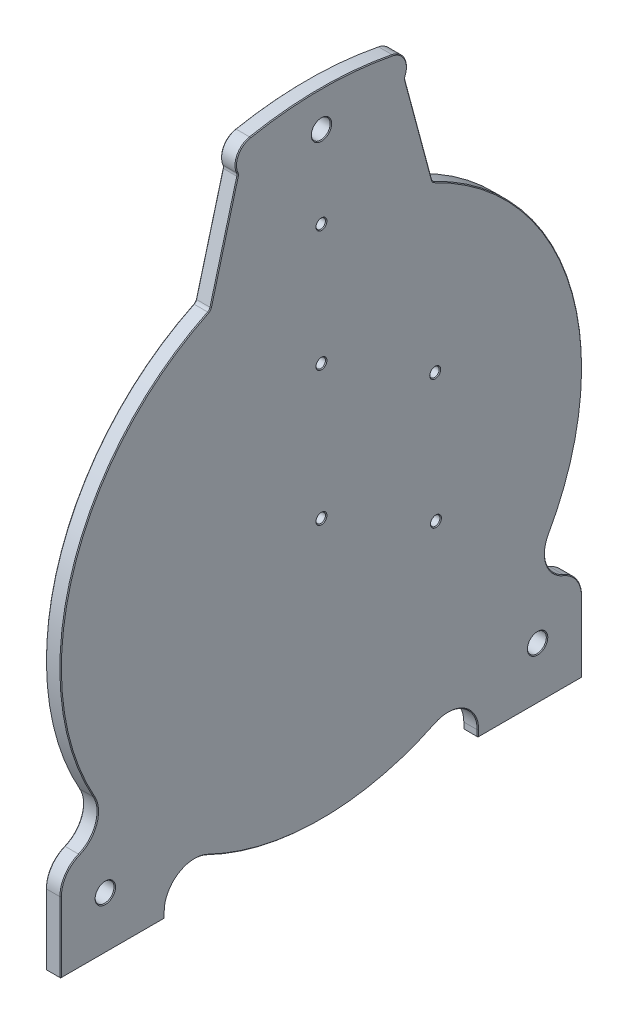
from build123d import *

# Parameters (mm, degrees)
SKETCH_1_R      = 3.175
SKETCH_1_R_2    = 6.35
EXTRUDE_1_DEPTH = 10
FILLET_1_R      = 3
CHAMFER_1_SIZE  = 0.5


with BuildPart() as part:
    # Sketch 1 → Extrude 1 (new body)
    with BuildSketch(Plane(origin=(0, 0, 0), x_dir=(0, 0, -1), z_dir=(1, 0, 0))):
        with BuildLine():
            Line((-56.02, 227.837072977), (-74.659059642, 158.275155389))
            ThreePointArc((-74.659059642, 158.275155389), (-166.695550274, 53.269067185), (-152.607561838, -85.650055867))
            ThreePointArc((-152.607561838, -85.650055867), (-151.17227957, -102.048557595), (-162.524213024, -113.96931684))
            ThreePointArc((-162.524213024, -113.96931684), (-171.590422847, -121.330493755), (-175, -132.5))
            Line((-175, -132.5), (-175, -180))
            Line((-175, -180), (-105, -180))
            Line((-105, -180), (-105, -175.499287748))
            ThreePointArc((-105, -175.499287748), (-95.621700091, -158.552916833), (-76.282051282, -157.499360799))
            ThreePointArc((-76.282051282, -157.499360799), (0, -175), (76.282051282, -157.499360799))
            ThreePointArc((76.282051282, -157.499360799), (95.621700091, -158.552916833), (105, -175.499287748))
            Line((105, -175.499287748), (105, -180))
            Line((105, -180), (175, -180))
            Line((175, -180), (175, -132.5))
            ThreePointArc((175, -132.5), (171.590422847, -121.330493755), (162.524213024, -113.96931684))
            ThreePointArc((162.524213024, -113.96931684), (151.17227957, -102.048557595), (152.607561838, -85.650055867))
            ThreePointArc((152.607561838, -85.650055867), (166.695550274, 53.269067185), (74.659059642, 158.275155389))
            Line((74.659059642, 158.275155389), (56.02, 227.837072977))
            ThreePointArc((56.02, 227.837072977), (56.365875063, 238.702674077), (47.794117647, 245.388920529))
            ThreePointArc((47.794117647, 245.388920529), (0, 250), (-47.794117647, 245.388920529))
            ThreePointArc((-47.794117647, 245.388920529), (-56.365875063, 238.702674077), (-56.02, 227.837072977))
        make_face()
        Circle(SKETCH_1_R, mode=Mode.SUBTRACT)
        with Locations((0, 90)):
            Circle(SKETCH_1_R, mode=Mode.SUBTRACT)
        with Locations((0, 171)):
            Circle(SKETCH_1_R, mode=Mode.SUBTRACT)
        with Locations((0, 226)):
            Circle(SKETCH_1_R_2, mode=Mode.SUBTRACT)
        with Locations((76.32, 46.615260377)):
            Circle(SKETCH_1_R, mode=Mode.SUBTRACT)
        with Locations((76.81, -39.997298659)):
            Circle(SKETCH_1_R, mode=Mode.SUBTRACT)
        with Locations((-145, -145)):
            Circle(SKETCH_1_R_2, mode=Mode.SUBTRACT)
        with Locations(Location((145, -145, 0), (0, 0, 180))):
            Circle(SKETCH_1_R_2, mode=Mode.SUBTRACT)
    extrude(amount=EXTRUDE_1_DEPTH)

    # Fillet 1
    fillet_1_edges = [part.edges().sort_by_distance(p)[0] for p in [
        (5, 227.837072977, -56.02),
        (5, 158.275155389, -74.659059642),
        (5, 158.275155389, 74.659059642),
        (5, 227.837072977, 56.02),
    ]]
    fillet(fillet_1_edges, radius=FILLET_1_R)

    # Chamfer 1
    chamfer_1_edges = [part.edges().sort_by_distance(p)[0] for p in [
        (10, 239.15496443, 56.142188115),
        (0, 52.615222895, -166.903080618),
        (0, -102.048557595, -151.17227957),
        (0, -121.330493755, -171.590422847),
        (0, -156.25, -175),
        (10, -102.048557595, 151.17227957),
        (0, -180, -140),
        (0, -177.749643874, -105),
        (0, -158.552916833, -95.621700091),
        (0, -175, 0),
        (0, -158.552916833, 95.621700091),
        (0, -177.749643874, 105),
        (0, -180, 140),
        (10, -121.330493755, 171.590422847),
        (0, -156.25, 175),
        (0, -121.330493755, 171.590422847),
        (0, -102.048557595, 151.17227957),
        (0, 239.15496443, 56.142188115),
        (0, 250, 0),
        (10, -156.25, 175),
        (10, -180, 140),
        (10, -177.749643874, 105),
        (5, -180, -175),
        (5, -180, -105),
        (5, -180, 105),
        (5, -180, 175),
        (10, -158.552916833, 95.621700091),
        (10, -175, 0),
        (10, -158.552916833, -95.621700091),
        (10, -177.749643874, -105),
        (10, -180, -140),
        (0, 0, 3.175),
        (10, 0, 3.175),
        (10, -156.25, -175),
        (0, 90, 3.175),
        (10, 90, 3.175),
        (10, -121.330493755, -171.590422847),
        (0, 171, 3.175),
        (10, -102.048557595, -151.17227957),
        (10, 171, 3.175),
        (10, 52.615222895, -166.903080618),
        (0, 226, 6.35),
        (10, 226, 6.35),
        (0, 46.615260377, -73.145),
        (10, 46.615260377, -73.145),
        (0, -39.997298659, -73.635),
        (10, -39.997298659, -73.635),
        (10, 250, 0),
        (0, -145, 151.35),
        (10, -145, 151.35),
        (0, -145, -151.35),
        (10, -145, -151.35),
        (0, 239.15496443, -56.142188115),
        (10, 239.15496443, -56.142188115),
        (0, 193.179586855, -65.306445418),
        (10, 193.179586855, -65.306445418),
        (0, 193.179586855, 65.306445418),
        (10, 193.179586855, 65.306445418),
        (0, 52.615222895, 166.903080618),
        (10, 52.615222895, 166.903080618),
        (0, 227.757707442, -56.218854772),
        (10, 227.757707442, -56.218854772),
        (0, 158.473915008, -74.888798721),
        (10, 158.473915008, -74.888798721),
        (0, 227.757707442, 56.218854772),
        (10, 227.757707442, 56.218854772),
        (0, 158.473915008, 74.888798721),
        (10, 158.473915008, 74.888798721),
    ]]
    chamfer(chamfer_1_edges, length=CHAMFER_1_SIZE)


solid = part.part
